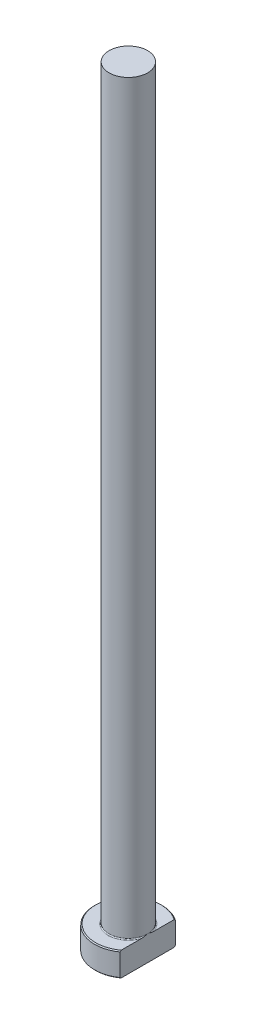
from build123d import *
from build123d.topology import SkipClean

# Parameters (mm, degrees)
CHAMFER1_SIZE = 0.2
FILLET1_R     = 0.2
KEY_DEPTH     = 161.305957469


with BuildPart() as part:
    # Sketch1 → Revolve1 (revolve)
    with BuildSketch(Plane.XY, mode=Mode.PRIVATE) as revolve1_sk:
        Polygon((0, 0), (-7, 0), (-7, 5), (-4, 5), (-4, 160), (0, 160), align=None)
    revolve(revolve1_sk.sketch.rotate(Axis((0, 259.958771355, 0), (0, -1, 0)), 270), axis=Axis((0, 259.958771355, 0), (0, -1, 0)))

    # Chamfer1
    chamfer1_edges = [part.edges().sort_by_distance(p)[0] for p in [
        (0, 5, -7),
        (0, 0, -7),
    ]]
    chamfer(chamfer1_edges, length=CHAMFER1_SIZE)

    # Fillet1
    fillet1_edges = [part.edges().sort_by_distance(p)[0] for p in [
        (0, 5, -4),
    ]]
    fillet(fillet1_edges, radius=FILLET1_R)

    # Sketch2 → KEY (cut, through all)
    with SkipClean():  # the faces are left unmerged after this step: merging them gives an invalid solid
        with BuildSketch(Plane(origin=(0, 0, 0), x_dir=(1, 0, 0), z_dir=(0, 1, 0))):
            with BuildLine():
                Line((4, 5.744562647), (4, -5.744562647))
                ThreePointArc((4, -5.744562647), (7, 0), (4, 5.744562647))
            make_face()
        extrude(amount=KEY_DEPTH, mode=Mode.SUBTRACT)


solid = part.part
